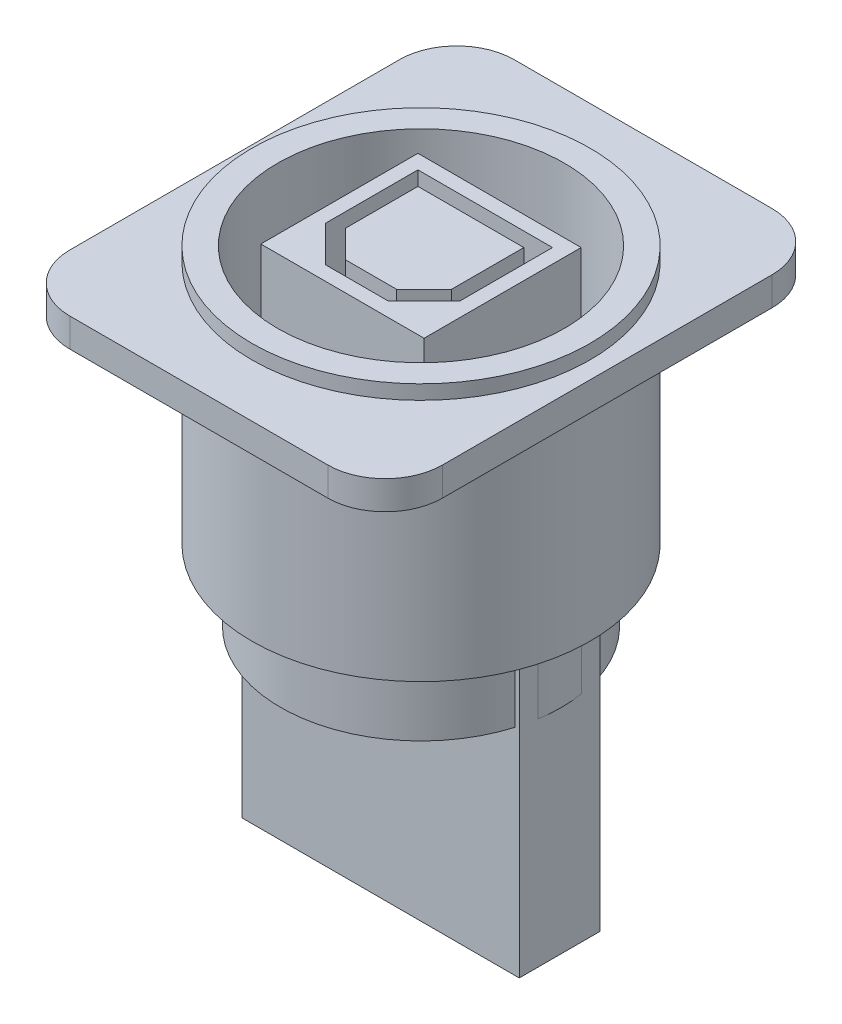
from build123d import *

# Parameters (mm, degrees)
CROQUIS1_R              = 11.8
SALIENTE_EXTRUIR1_DEPTH = 18
SALIENTE_EXTRUIR2_START = -3
CROQUIS2_W              = 26
CROQUIS2_H              = 31
SALIENTE_EXTRUIR2_DEPTH = 2
REDONDEO1_R             = 4
CROQUIS3_R              = 10
CORTAR_EXTRUIR1_DEPTH   = 10
CROQUIS4_W              = 11.3899408
CROQUIS4_H              = 10.96281802
SALIENTE_EXTRUIR3_DEPTH = 10
CROQUIS5_W              = 9.3899408
CROQUIS5_H              = 8.96281802
CORTAR_EXTRUIR2_DEPTH   = 10
CHAFL_N1_SIZE           = 2.5
SALIENTE_EXTRUIR4_DEPTH = 10
CROQUIS7_W              = 19.362899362
CROQUIS7_H              = 5.647512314
SALIENTE_EXTRUIR5_DEPTH = 20
CROQUIS8_R              = 9.8
SALIENTE_EXTRUIR6_DEPTH = 5
CROQUIS9_W              = 17.844240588
CROQUIS9_H              = 3.416982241
CORTAR_EXTRUIR3_DEPTH   = 10


with BuildPart() as part:
    # Croquis1 → Saliente-Extruir1 (new body)
    with BuildSketch(Plane(origin=(0, 0, 0), x_dir=(1, 0, 0), z_dir=(0, 1, 0))):
        with Locations(Location((0, 0, 0), (0, 0, 270))):
            Circle(CROQUIS1_R)
    extrude(amount=SALIENTE_EXTRUIR1_DEPTH)

    # Croquis2 → Saliente-Extruir2 (add)
    with BuildSketch(Plane(origin=(0, 18, 0), x_dir=(1, 0, 0), z_dir=(0, 1, 0)).offset(SALIENTE_EXTRUIR2_START)):
        Rectangle(CROQUIS2_W, CROQUIS2_H)
    extrude(amount=SALIENTE_EXTRUIR2_DEPTH)

    # Redondeo1
    redondeo1_edges = [part.edges().sort_by_distance(p)[0] for p in [
        (13, 16, -15.5),
        (-13, 16, -15.5),
        (-13, 16, 15.5),
        (13, 16, 15.5),
    ]]
    fillet(redondeo1_edges, radius=REDONDEO1_R)

    # Croquis3 → Cortar-Extruir1 (cut)
    with BuildSketch(Plane(origin=(0, 18, 0), x_dir=(1, 0, 0), z_dir=(0, 1, 0))):
        with Locations(Location((0, 0, 0), (0, 0, 270))):
            Circle(CROQUIS3_R)
    extrude(amount=-CORTAR_EXTRUIR1_DEPTH, mode=Mode.SUBTRACT)

    # Croquis4 → Saliente-Extruir3 (add)
    with BuildSketch(Plane(origin=(0, 8, 0), x_dir=(1, 0, 0), z_dir=(0, 1, 0))):
        Rectangle(CROQUIS4_W, CROQUIS4_H)
    extrude(amount=SALIENTE_EXTRUIR3_DEPTH)

    # Croquis5 → Cortar-Extruir2 (cut)
    with BuildSketch(Plane(origin=(0, 18, 0), x_dir=(1, 0, 0), z_dir=(0, 1, 0))):
        Rectangle(CROQUIS5_W, CROQUIS5_H)
    extrude(amount=-CORTAR_EXTRUIR2_DEPTH, mode=Mode.SUBTRACT)

    # Chafl_n1
    chafl_n1_edges = [part.edges().sort_by_distance(p)[0] for p in [
        (4.6949704, 13, 4.48140901),
        (-4.6949704, 13, 4.48140901),
    ]]
    chamfer(chafl_n1_edges, length=CHAFL_N1_SIZE)

    # Croquis6 → Saliente-Extruir4 (add)
    with BuildSketch(Plane(origin=(0, 8, 0), x_dir=(1, 0, 0), z_dir=(0, 1, 0))):
        Polygon((-1.780756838, -3.48140901), (1.780756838, -3.48140901), (3.6949704, -1.567195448), (3.6949704, 3.48140901), (-3.6949704, 3.48140901), (-3.6949704, -1.567195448), align=None)
    extrude(amount=SALIENTE_EXTRUIR4_DEPTH)

    # Croquis7 → Saliente-Extruir5 (add)
    with BuildSketch(Plane.XZ):
        Rectangle(CROQUIS7_W, CROQUIS7_H)
    extrude(amount=SALIENTE_EXTRUIR5_DEPTH)

    # Croquis8 → Saliente-Extruir6 (add)
    with BuildSketch(Plane.XZ):
        Circle(CROQUIS8_R)
    extrude(amount=SALIENTE_EXTRUIR6_DEPTH)

    # Croquis9 → Cortar-Extruir3 (cut)
    with BuildSketch(Plane.XZ.offset(20)):
        with Locations((0, 0.450851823)):
            Rectangle(CROQUIS9_W, CROQUIS9_H)
    extrude(amount=-CORTAR_EXTRUIR3_DEPTH, mode=Mode.SUBTRACT)


solid = part.part
